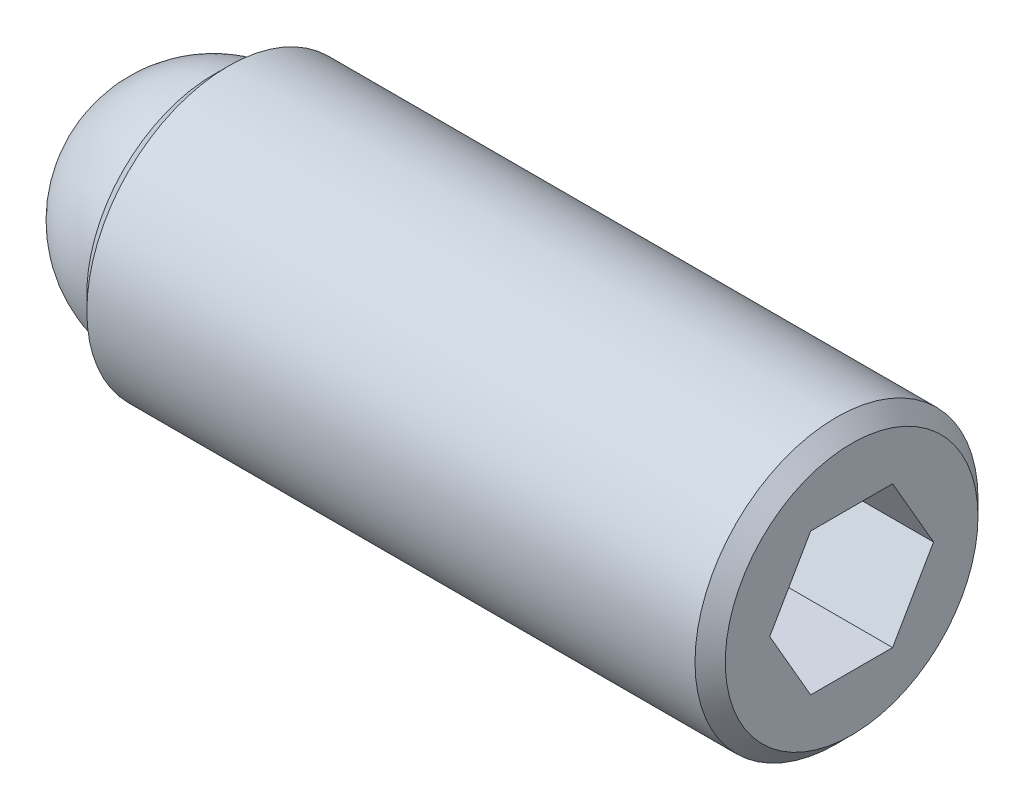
from build123d import *

# Parameters (mm, degrees)
SKETCH2_R           = 2.3749
BOSS_EXTRUDE1_DEPTH = 10.715625
CHAMFER1_SIZE       = 0.254
CHAMFER2_SIZE       = 0.254
CUT_EXTRUDE2_DEPTH  = 2.286
SKETCH3_R           = 1.9812
CUT_EXTRUDE3_DEPTH  = 1.984375


with BuildPart() as part:
    # Sketch2 → Boss-Extrude1 (new body)
    with BuildSketch(Plane(origin=(0, 0, 0), x_dir=(0, 0, -1), z_dir=(1, 0, 0))):
        Circle(SKETCH2_R)
    extrude(amount=BOSS_EXTRUDE1_DEPTH)

    # Chamfer1
    chamfer1_edges = [part.edges().sort_by_distance(p)[0] for p in [
        (0, 0, 2.3749),
    ]]
    chamfer(chamfer1_edges, length=CHAMFER1_SIZE)

    # Chamfer2
    chamfer2_edges = [part.edges().sort_by_distance(p)[0] for p in [
        (10.715625, 0, 2.3749),
    ]]
    chamfer(chamfer2_edges, length=CHAMFER2_SIZE)

    # Sketch4 → Cut-Extrude2 (cut)
    with BuildSketch(Plane(origin=(10.715625, 0, 0), x_dir=(0, 0, -1), z_dir=(1, 0, 0))):
        Polygon((1.374815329, 0), (0.687407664, 1.190625), (-0.687407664, 1.190625), (-1.374815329, 0), (-0.687407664, -1.190625), (0.687407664, -1.190625), align=None)
    extrude(amount=-CUT_EXTRUDE2_DEPTH, mode=Mode.SUBTRACT)

    # Sketch3 → Cut-Extrude3 (cut)
    with BuildSketch(Plane.ZY):
        Circle(SKETCH3_R)
    extrude(amount=-CUT_EXTRUDE3_DEPTH, mode=Mode.SUBTRACT)


with BuildPart() as body_2:
    # Sketch5 → Revolve1 (revolve)
    with BuildSketch(Plane.ZY):
        with BuildLine():
            Line((0, 0), (0, -1.984375))
            ThreePointArc((0, -1.984375), (-1.984375, 0), (0, 1.984375))
            Line((0, 1.984375), (0, 0))
        make_face()
    revolve(axis=Axis((0, 0, 0), (0, 1, 0)))


solid = Compound([part.part, body_2.part])
